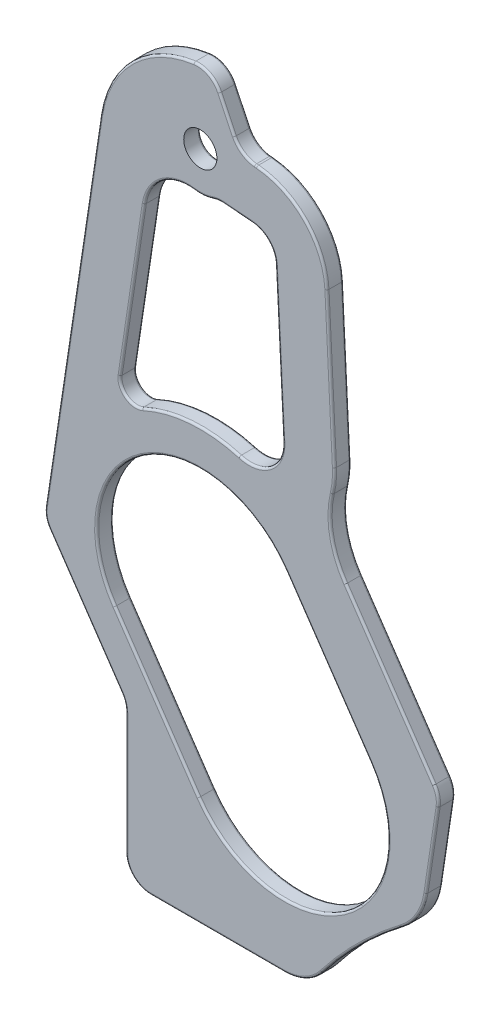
from build123d import *

# Parameters (mm, degrees)
SKETCH1_R          = 2
BASE_EXTRUDE_DEPTH = 2
FILLET1_R          = 0.25


with BuildPart() as part:
    # Sketch1 → Base-Extrude (new body)
    with BuildSketch(Plane.XY):
        with BuildLine():
            Line((37.192786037, 28.595350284), (26.522947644, 44.2480406))
            ThreePointArc((26.522947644, 44.2480406), (24.826434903, 48.354740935), (24.921309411, 52.797052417))
            ThreePointArc((24.921309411, 52.797052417), (25.147082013, 54.209536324), (25.175230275, 55.639673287))
            Line((25.175230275, 55.639673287), (24.271909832, 73.788891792))
            ThreePointArc((24.271909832, 73.788891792), (21.683085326, 79.754948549), (15.804668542, 82.537045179))
            Line((15.804668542, 82.537045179), (15.55786182, 82.557418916))
            ThreePointArc((15.55786182, 82.557418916), (14.105093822, 83.075116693), (13.101494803, 84.246156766))
            Line((13.101494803, 84.246156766), (11.326251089, 87.934438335))
            ThreePointArc((11.326251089, 87.934438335), (10.046612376, 89.27409246), (8.224108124, 89.606698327))
            ThreePointArc((8.224108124, 89.606698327), (0.744261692, 85.943552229), (-3.037758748, 78.523103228))
            Line((-3.037758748, 78.523103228), (-9.697280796, 34.262060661))
            ThreePointArc((-9.697280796, 34.262060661), (-9.655398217, 33.147888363), (-9.209534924, 32.125958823))
            Line((-9.209534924, 32.125958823), (-0.521137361, 19.38004915))
            ThreePointArc((-0.521137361, 19.38004915), (-0.133243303, 18.574445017), (0, 17.690303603))
            Line((0, 17.690303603), (0, 3))
            ThreePointArc((0, 3), (0.878679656, 0.878679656), (3, 0))
            Line((3, 0), (19.150603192, 0))
            ThreePointArc((19.150603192, 0), (21.657047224, 0.582412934), (23.649890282, 2.210308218))
            ThreePointArc((23.649890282, 2.210308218), (28.151546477, 7.307386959), (33.284083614, 11.768573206))
            ThreePointArc((33.284083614, 11.768573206), (35.231353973, 13.952335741), (36.213426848, 16.708458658))
            Line((36.213426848, 16.708458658), (37.680531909, 26.459248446))
            ThreePointArc((37.680531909, 26.459248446), (37.63864933, 27.573420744), (37.192786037, 28.595350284))
        make_face()
        with Locations(Location((9, 80.95029217, 0), (0, 0, 180))):
            Circle(SKETCH1_R, mode=Mode.SUBTRACT)
        with BuildLine():
            Line((29.467067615, 27.16743061), (19.328594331, 42.040606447))
            ThreePointArc((19.328594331, 42.040606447), (1.959393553, 45.328594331), (-1.328594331, 27.959393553))
            Line((-1.328594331, 27.959393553), (8.809878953, 13.086217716))
            ThreePointArc((8.809878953, 13.086217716), (26.179079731, 9.798229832), (29.467067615, 27.16743061))
        make_face(mode=Mode.SUBTRACT)
        with BuildLine():
            Line((18.040893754, 73.478764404), (18.944214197, 55.329545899))
            ThreePointArc((18.944214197, 55.329545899), (17.399690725, 51.92962985), (13.734087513, 51.216653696))
            ThreePointArc((13.734087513, 51.216653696), (7.778387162, 51.849305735), (1.976230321, 50.364182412))
            ThreePointArc((1.976230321, 50.364182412), (0.062167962, 50.572569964), (-0.66607837, 52.354904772))
            Line((-0.66607837, 52.354904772), (2.252617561, 71.753372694))
            ThreePointArc((2.252617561, 71.753372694), (4.354063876, 75.250751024), (8.311078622, 76.245620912))
            ThreePointArc((8.311078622, 76.245620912), (9.44377002, 76.21620171), (10.551261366, 76.455613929))
            ThreePointArc((10.551261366, 76.455613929), (11.156028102, 76.596360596), (11.776815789, 76.609592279))
            Line((11.776815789, 76.609592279), (15.291411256, 76.319464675))
            ThreePointArc((15.291411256, 76.319464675), (17.200250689, 75.416062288), (18.040893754, 73.478764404))
        make_face(mode=Mode.SUBTRACT)
    extrude(amount=BASE_EXTRUDE_DEPTH)

    # Fillet1
    fillet1_edges = [part.edges().sort_by_distance(p)[0] for p in [
        (36.946979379, 21.583853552, 0),
        (36.946979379, 21.583853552, 2),
        (37.63864933, 27.573420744, 0),
        (37.63864933, 27.573420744, 2),
        (31.85786684, 36.421695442, 0),
        (31.85786684, 36.421695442, 2),
        (24.826435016, 48.354740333, 0),
        (24.826435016, 48.354740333, 2),
        (25.147082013, 54.209536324, 0),
        (25.147082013, 54.209536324, 2),
        (24.723570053, 64.71428254, 0),
        (24.723570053, 64.71428254, 2),
        (21.683085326, 79.754948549, 0),
        (21.683085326, 79.754948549, 2),
        (15.681265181, 82.547232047, 0),
        (15.681265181, 82.547232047, 2),
        (14.105093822, 83.075116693, 0),
        (14.105093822, 83.075116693, 2),
        (12.213872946, 86.090297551, 0),
        (12.213872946, 86.090297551, 2),
        (10.046612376, 89.27409246, 0),
        (10.046612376, 89.27409246, 2),
        (0.744261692, 85.943552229, 0),
        (0.744261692, 85.943552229, 2),
        (-6.367519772, 56.392581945, 0),
        (-6.367519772, 56.392581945, 2),
        (-9.655398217, 33.147888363, 0),
        (-9.655398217, 33.147888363, 2),
        (-4.865336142, 25.753003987, 0),
        (-4.865336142, 25.753003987, 2),
        (-0.133243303, 18.574445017, 0),
        (-0.133243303, 18.574445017, 2),
        (0, 10.345151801, 0),
        (0, 10.345151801, 2),
        (0.878679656, 0.878679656, 0),
        (0.878679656, 0.878679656, 2),
        (11.075301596, 0, 0),
        (11.075301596, 0, 2),
        (21.657047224, 0.582412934, 0),
        (21.657047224, 0.582412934, 2),
        (28.151546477, 7.307386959, 0),
        (28.151546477, 7.307386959, 2),
        (35.231353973, 13.952335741, 0),
        (35.231353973, 13.952335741, 2),
        (11, 80.95029217, 0),
        (1.959393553, 45.328594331, 0),
        (1.959393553, 45.328594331, 2),
        (24.397830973, 34.604018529, 0),
        (24.397830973, 34.604018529, 2),
        (26.179079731, 9.798229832, 0),
        (26.179079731, 9.798229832, 2),
        (3.740642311, 20.522805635, 0),
        (3.740642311, 20.522805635, 2),
        (18.492553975, 64.404155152, 0),
        (18.492553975, 64.404155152, 2),
        (17.399690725, 51.92962985, 0),
        (17.399690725, 51.92962985, 2),
        (7.778387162, 51.849305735, 0),
        (7.778387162, 51.849305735, 2),
        (0.062167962, 50.572569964, 0),
        (0.062167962, 50.572569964, 2),
        (0.793269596, 62.054138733, 0),
        (0.793269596, 62.054138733, 2),
        (4.354063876, 75.250751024, 0),
        (4.354063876, 75.250751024, 2),
        (9.44377002, 76.21620171, 0),
        (9.44377002, 76.21620171, 2),
        (11.156028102, 76.596360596, 0),
        (11.156028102, 76.596360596, 2),
        (13.534113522, 76.464528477, 0),
        (13.534113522, 76.464528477, 2),
        (17.200250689, 75.416062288, 0),
        (17.200250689, 75.416062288, 2),
    ]]
    fillet(fillet1_edges, radius=FILLET1_R)


solid = part.part
